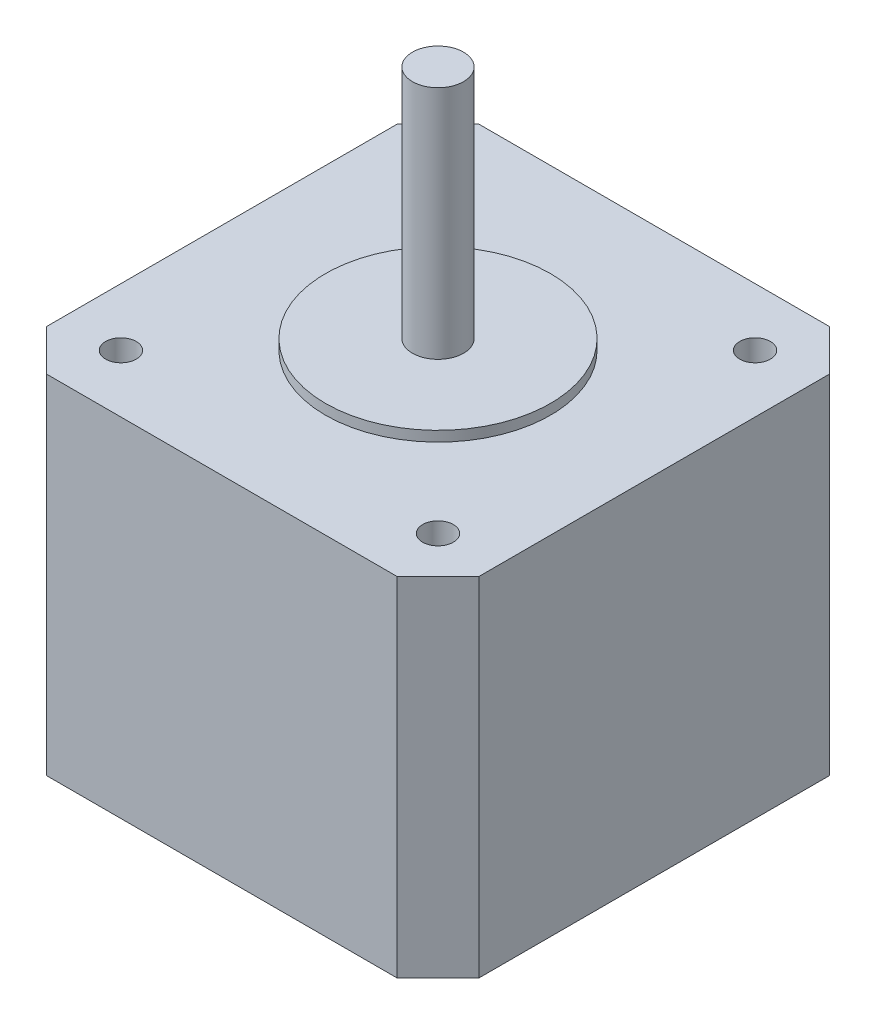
ISO-10303-21;
HEADER;
FILE_DESCRIPTION(('STEP AP214'),'2;1');
FILE_NAME('part.step','',(''),(''),'','','');
FILE_SCHEMA(('AUTOMOTIVE_DESIGN { 1 0 10303 214 1 1 1 1 }'));
ENDSEC;
DATA;
#1=APPLICATION_CONTEXT('core data for automotive mechanical design processes');
#2=APPLICATION_PROTOCOL_DEFINITION('international standard','automotive_design',2000,#1);
#3=PRODUCT_CONTEXT('',#1,'mechanical');
#4=PRODUCT('Part','Part','',(#3));
#5=PRODUCT_RELATED_PRODUCT_CATEGORY('part','',(#4));
#6=PRODUCT_DEFINITION_FORMATION('','',#4);
#7=PRODUCT_DEFINITION_CONTEXT('part definition',#1,'design');
#8=PRODUCT_DEFINITION('design','',#6,#7);
#9=PRODUCT_DEFINITION_SHAPE('','',#8);
#10=(LENGTH_UNIT() NAMED_UNIT(*) SI_UNIT(.MILLI.,.METRE.));
#11=(NAMED_UNIT(*) PLANE_ANGLE_UNIT() SI_UNIT($,.RADIAN.));
#12=(NAMED_UNIT(*) SI_UNIT($,.STERADIAN.) SOLID_ANGLE_UNIT());
#13=UNCERTAINTY_MEASURE_WITH_UNIT(LENGTH_MEASURE(1.E-05),#10,'distance_accuracy_value','');
#14=(GEOMETRIC_REPRESENTATION_CONTEXT(3) GLOBAL_UNCERTAINTY_ASSIGNED_CONTEXT((#13)) GLOBAL_UNIT_ASSIGNED_CONTEXT((#10,
#11,#12)) REPRESENTATION_CONTEXT('',''));
#15=CARTESIAN_POINT('',(0.,0.,0.));
#16=DIRECTION('',(0.,0.,1.));
#17=DIRECTION('',(1.,0.,0.));
#18=AXIS2_PLACEMENT_3D('',#15,#16,#17);
#19=CARTESIAN_POINT('',(0.,34.,0.));
#20=DIRECTION('',(1.,0.,0.));
#21=DIRECTION('',(0.,0.,-1.));
#22=AXIS2_PLACEMENT_3D('',#19,#20,#21);
#23=PLANE('',#22);
#24=DIRECTION('',(0.,0.,1.));
#25=VECTOR('',#24,1.);
#26=CARTESIAN_POINT('',(0.,34.,0.));
#27=LINE('',#26,#25);
#28=CARTESIAN_POINT('',(0.,34.,-38.3));
#29=VERTEX_POINT('',#28);
#30=CARTESIAN_POINT('',(0.,34.,-4.));
#31=VERTEX_POINT('',#30);
#32=EDGE_CURVE('E130',#29,#31,#27,.T.);
#33=ORIENTED_EDGE('',*,*,#32,.F.);
#34=DIRECTION('',(0.,-1.,0.));
#35=VECTOR('',#34,1.);
#36=CARTESIAN_POINT('',(0.,34.,-38.3));
#37=LINE('',#36,#35);
#38=CARTESIAN_POINT('',(0.,0.,-38.3));
#39=VERTEX_POINT('',#38);
#40=EDGE_CURVE('E115',#29,#39,#37,.T.);
#41=ORIENTED_EDGE('',*,*,#40,.T.);
#42=DIRECTION('',(0.,0.,1.));
#43=VECTOR('',#42,1.);
#44=CARTESIAN_POINT('',(0.,0.,0.));
#45=LINE('',#44,#43);
#46=CARTESIAN_POINT('',(0.,0.,-4.));
#47=VERTEX_POINT('',#46);
#48=EDGE_CURVE('E127',#39,#47,#45,.T.);
#49=ORIENTED_EDGE('',*,*,#48,.T.);
#50=DIRECTION('',(0.,1.,0.));
#51=VECTOR('',#50,1.);
#52=CARTESIAN_POINT('',(0.,34.,-4.));
#53=LINE('',#52,#51);
#54=EDGE_CURVE('E132',#47,#31,#53,.T.);
#55=ORIENTED_EDGE('',*,*,#54,.T.);
#56=EDGE_LOOP('',(#33,#41,#49,#55));
#57=FACE_BOUND('',#56,.T.);
#58=ADVANCED_FACE('F42',(#57),#23,.F.);
#59=CARTESIAN_POINT('',(0.,34.,0.));
#60=DIRECTION('',(0.,0.,-1.));
#61=DIRECTION('',(-1.,0.,0.));
#62=AXIS2_PLACEMENT_3D('',#59,#60,#61);
#63=PLANE('',#62);
#64=DIRECTION('',(1.,0.,0.));
#65=VECTOR('',#64,1.);
#66=CARTESIAN_POINT('',(0.,34.,0.));
#67=LINE('',#66,#65);
#68=CARTESIAN_POINT('',(4.,34.,0.));
#69=VERTEX_POINT('',#68);
#70=CARTESIAN_POINT('',(38.3,34.,0.));
#71=VERTEX_POINT('',#70);
#72=EDGE_CURVE('E203',#69,#71,#67,.T.);
#73=ORIENTED_EDGE('',*,*,#72,.F.);
#74=DIRECTION('',(0.,-1.,0.));
#75=VECTOR('',#74,1.);
#76=CARTESIAN_POINT('',(4.,34.,0.));
#77=LINE('',#76,#75);
#78=CARTESIAN_POINT('',(4.,0.,0.));
#79=VERTEX_POINT('',#78);
#80=EDGE_CURVE('E169',#69,#79,#77,.T.);
#81=ORIENTED_EDGE('',*,*,#80,.T.);
#82=DIRECTION('',(1.,0.,0.));
#83=VECTOR('',#82,1.);
#84=CARTESIAN_POINT('',(0.,0.,0.));
#85=LINE('',#84,#83);
#86=CARTESIAN_POINT('',(38.3,0.,0.));
#87=VERTEX_POINT('',#86);
#88=EDGE_CURVE('E136',#79,#87,#85,.T.);
#89=ORIENTED_EDGE('',*,*,#88,.T.);
#90=DIRECTION('',(0.,1.,0.));
#91=VECTOR('',#90,1.);
#92=CARTESIAN_POINT('',(38.3,34.,0.));
#93=LINE('',#92,#91);
#94=EDGE_CURVE('E167',#87,#71,#93,.T.);
#95=ORIENTED_EDGE('',*,*,#94,.T.);
#96=EDGE_LOOP('',(#73,#81,#89,#95));
#97=FACE_BOUND('',#96,.T.);
#98=ADVANCED_FACE('F216',(#97),#63,.F.);
#99=CARTESIAN_POINT('',(42.3,34.,0.));
#100=DIRECTION('',(-1.,0.,0.));
#101=DIRECTION('',(0.,0.,1.));
#102=AXIS2_PLACEMENT_3D('',#99,#100,#101);
#103=PLANE('',#102);
#104=DIRECTION('',(0.,0.,-1.));
#105=VECTOR('',#104,1.);
#106=CARTESIAN_POINT('',(42.3,0.,0.));
#107=LINE('',#106,#105);
#108=CARTESIAN_POINT('',(42.3,0.,-4.));
#109=VERTEX_POINT('',#108);
#110=CARTESIAN_POINT('',(42.3,0.,-38.3));
#111=VERTEX_POINT('',#110);
#112=EDGE_CURVE('E140',#109,#111,#107,.T.);
#113=ORIENTED_EDGE('',*,*,#112,.T.);
#114=DIRECTION('',(0.,1.,0.));
#115=VECTOR('',#114,1.);
#116=CARTESIAN_POINT('',(42.3,34.,-38.3));
#117=LINE('',#116,#115);
#118=CARTESIAN_POINT('',(42.3,34.,-38.3));
#119=VERTEX_POINT('',#118);
#120=EDGE_CURVE('E47',#111,#119,#117,.T.);
#121=ORIENTED_EDGE('',*,*,#120,.T.);
#122=DIRECTION('',(0.,0.,-1.));
#123=VECTOR('',#122,1.);
#124=CARTESIAN_POINT('',(42.3,34.,0.));
#125=LINE('',#124,#123);
#126=CARTESIAN_POINT('',(42.3,34.,-4.));
#127=VERTEX_POINT('',#126);
#128=EDGE_CURVE('E204',#127,#119,#125,.T.);
#129=ORIENTED_EDGE('',*,*,#128,.F.);
#130=DIRECTION('',(0.,-1.,0.));
#131=VECTOR('',#130,1.);
#132=CARTESIAN_POINT('',(42.3,34.,-4.));
#133=LINE('',#132,#131);
#134=EDGE_CURVE('E171',#127,#109,#133,.T.);
#135=ORIENTED_EDGE('',*,*,#134,.T.);
#136=EDGE_LOOP('',(#113,#121,#129,#135));
#137=FACE_BOUND('',#136,.T.);
#138=ADVANCED_FACE('F214',(#137),#103,.F.);
#139=CARTESIAN_POINT('',(0.,34.,-42.3));
#140=DIRECTION('',(0.,0.,1.));
#141=DIRECTION('',(1.,0.,0.));
#142=AXIS2_PLACEMENT_3D('',#139,#140,#141);
#143=PLANE('',#142);
#144=DIRECTION('',(-1.,0.,0.));
#145=VECTOR('',#144,1.);
#146=CARTESIAN_POINT('',(0.,0.,-42.3));
#147=LINE('',#146,#145);
#148=CARTESIAN_POINT('',(38.3,0.,-42.3));
#149=VERTEX_POINT('',#148);
#150=CARTESIAN_POINT('',(4.,0.,-42.3));
#151=VERTEX_POINT('',#150);
#152=EDGE_CURVE('E150',#149,#151,#147,.T.);
#153=ORIENTED_EDGE('',*,*,#152,.T.);
#154=DIRECTION('',(0.,1.,0.));
#155=VECTOR('',#154,1.);
#156=CARTESIAN_POINT('',(4.,34.,-42.3));
#157=LINE('',#156,#155);
#158=CARTESIAN_POINT('',(4.,34.,-42.3));
#159=VERTEX_POINT('',#158);
#160=EDGE_CURVE('E116',#151,#159,#157,.T.);
#161=ORIENTED_EDGE('',*,*,#160,.T.);
#162=DIRECTION('',(-1.,0.,0.));
#163=VECTOR('',#162,1.);
#164=CARTESIAN_POINT('',(0.,34.,-42.3));
#165=LINE('',#164,#163);
#166=CARTESIAN_POINT('',(38.3,34.,-42.3));
#167=VERTEX_POINT('',#166);
#168=EDGE_CURVE('E146',#167,#159,#165,.T.);
#169=ORIENTED_EDGE('',*,*,#168,.F.);
#170=DIRECTION('',(0.,-1.,0.));
#171=VECTOR('',#170,1.);
#172=CARTESIAN_POINT('',(38.3,34.,-42.3));
#173=LINE('',#172,#171);
#174=EDGE_CURVE('E121',#167,#149,#173,.T.);
#175=ORIENTED_EDGE('',*,*,#174,.T.);
#176=EDGE_LOOP('',(#153,#161,#169,#175));
#177=FACE_BOUND('',#176,.T.);
#178=ADVANCED_FACE('F211',(#177),#143,.F.);
#179=CARTESIAN_POINT('',(0.,34.,0.));
#180=DIRECTION('',(0.,-1.,0.));
#181=DIRECTION('',(0.,0.,-1.));
#182=AXIS2_PLACEMENT_3D('',#179,#180,#181);
#183=PLANE('',#182);
#184=CARTESIAN_POINT('',(21.15,34.,-21.15));
#185=DIRECTION('',(0.,1.,0.));
#186=DIRECTION('',(0.,0.,1.));
#187=AXIS2_PLACEMENT_3D('',#184,#185,#186);
#188=CIRCLE('',#187,11.);
#189=CARTESIAN_POINT('',(21.15,34.,-10.15));
#190=VERTEX_POINT('',#189);
#191=EDGE_CURVE('E52',#190,#190,#188,.T.);
#192=ORIENTED_EDGE('',*,*,#191,.F.);
#193=EDGE_LOOP('',(#192));
#194=FACE_BOUND('',#193,.T.);
#195=CARTESIAN_POINT('',(36.649999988,34.,-5.65));
#196=DIRECTION('',(0.,1.,0.));
#197=DIRECTION('',(0.,0.,1.));
#198=AXIS2_PLACEMENT_3D('',#195,#196,#197);
#199=CIRCLE('',#198,1.5);
#200=CARTESIAN_POINT('',(36.649999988,34.,-4.15));
#201=VERTEX_POINT('',#200);
#202=EDGE_CURVE('E197',#201,#201,#199,.T.);
#203=ORIENTED_EDGE('',*,*,#202,.F.);
#204=EDGE_LOOP('',(#203));
#205=FACE_BOUND('',#204,.T.);
#206=CARTESIAN_POINT('',(5.650000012,34.,-5.65));
#207=DIRECTION('',(0.,1.,0.));
#208=DIRECTION('',(0.,0.,1.));
#209=AXIS2_PLACEMENT_3D('',#206,#207,#208);
#210=CIRCLE('',#209,1.5);
#211=CARTESIAN_POINT('',(5.650000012,34.,-4.15));
#212=VERTEX_POINT('',#211);
#213=EDGE_CURVE('E191',#212,#212,#210,.T.);
#214=ORIENTED_EDGE('',*,*,#213,.F.);
#215=EDGE_LOOP('',(#214));
#216=FACE_BOUND('',#215,.T.);
#217=CARTESIAN_POINT('',(5.65000001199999,34.,-36.65));
#218=DIRECTION('',(0.,1.,0.));
#219=DIRECTION('',(0.,0.,1.));
#220=AXIS2_PLACEMENT_3D('',#217,#218,#219);
#221=CIRCLE('',#220,1.5);
#222=CARTESIAN_POINT('',(5.65000001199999,34.,-35.15));
#223=VERTEX_POINT('',#222);
#224=EDGE_CURVE('E185',#223,#223,#221,.T.);
#225=ORIENTED_EDGE('',*,*,#224,.F.);
#226=EDGE_LOOP('',(#225));
#227=FACE_BOUND('',#226,.T.);
#228=CARTESIAN_POINT('',(36.649999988,34.,-36.65));
#229=DIRECTION('',(0.,1.,0.));
#230=DIRECTION('',(0.,0.,1.));
#231=AXIS2_PLACEMENT_3D('',#228,#229,#230);
#232=CIRCLE('',#231,1.5);
#233=CARTESIAN_POINT('',(36.649999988,34.,-35.15));
#234=VERTEX_POINT('',#233);
#235=EDGE_CURVE('E143',#234,#234,#232,.T.);
#236=ORIENTED_EDGE('',*,*,#235,.F.);
#237=EDGE_LOOP('',(#236));
#238=FACE_BOUND('',#237,.T.);
#239=ORIENTED_EDGE('',*,*,#168,.T.);
#240=DIRECTION('',(0.707106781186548,0.,-0.707106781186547));
#241=VECTOR('',#240,1.);
#242=CARTESIAN_POINT('',(0.,34.,-38.3));
#243=LINE('',#242,#241);
#244=EDGE_CURVE('E165',#159,#29,#243,.F.);
#245=ORIENTED_EDGE('',*,*,#244,.T.);
#246=ORIENTED_EDGE('',*,*,#32,.T.);
#247=DIRECTION('',(-0.707106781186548,0.,-0.707106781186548));
#248=VECTOR('',#247,1.);
#249=CARTESIAN_POINT('',(4.,34.,0.));
#250=LINE('',#249,#248);
#251=EDGE_CURVE('E163',#31,#69,#250,.F.);
#252=ORIENTED_EDGE('',*,*,#251,.T.);
#253=ORIENTED_EDGE('',*,*,#72,.T.);
#254=DIRECTION('',(-0.707106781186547,0.,0.707106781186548));
#255=VECTOR('',#254,1.);
#256=CARTESIAN_POINT('',(42.3,34.,-4.));
#257=LINE('',#256,#255);
#258=EDGE_CURVE('E66',#71,#127,#257,.F.);
#259=ORIENTED_EDGE('',*,*,#258,.T.);
#260=ORIENTED_EDGE('',*,*,#128,.T.);
#261=DIRECTION('',(0.707106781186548,0.,0.707106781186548));
#262=VECTOR('',#261,1.);
#263=CARTESIAN_POINT('',(38.3,34.,-42.3));
#264=LINE('',#263,#262);
#265=EDGE_CURVE('E161',#119,#167,#264,.F.);
#266=ORIENTED_EDGE('',*,*,#265,.T.);
#267=EDGE_LOOP('',(#239,#245,#246,#252,#253,#259,#260,#266));
#268=FACE_BOUND('',#267,.T.);
#269=ADVANCED_FACE('F208',(#194,#205,#216,#227,#238,#268),#183,.F.);
#270=CARTESIAN_POINT('',(0.,0.,0.));
#271=DIRECTION('',(0.,-1.,0.));
#272=DIRECTION('',(0.,0.,-1.));
#273=AXIS2_PLACEMENT_3D('',#270,#271,#272);
#274=PLANE('',#273);
#275=ORIENTED_EDGE('',*,*,#48,.F.);
#276=DIRECTION('',(-0.707106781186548,0.,0.707106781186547));
#277=VECTOR('',#276,1.);
#278=CARTESIAN_POINT('',(-19.15,0.,-19.15));
#279=LINE('',#278,#277);
#280=EDGE_CURVE('E111',#39,#151,#279,.F.);
#281=ORIENTED_EDGE('',*,*,#280,.T.);
#282=ORIENTED_EDGE('',*,*,#152,.F.);
#283=DIRECTION('',(-0.707106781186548,0.,-0.707106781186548));
#284=VECTOR('',#283,1.);
#285=CARTESIAN_POINT('',(40.3,0.,-40.3));
#286=LINE('',#285,#284);
#287=EDGE_CURVE('E154',#149,#111,#286,.F.);
#288=ORIENTED_EDGE('',*,*,#287,.T.);
#289=ORIENTED_EDGE('',*,*,#112,.F.);
#290=DIRECTION('',(0.707106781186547,0.,-0.707106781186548));
#291=VECTOR('',#290,1.);
#292=CARTESIAN_POINT('',(19.15,0.,19.15));
#293=LINE('',#292,#291);
#294=EDGE_CURVE('E131',#109,#87,#293,.F.);
#295=ORIENTED_EDGE('',*,*,#294,.T.);
#296=ORIENTED_EDGE('',*,*,#88,.F.);
#297=DIRECTION('',(0.707106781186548,0.,0.707106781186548));
#298=VECTOR('',#297,1.);
#299=CARTESIAN_POINT('',(2.,0.,-2.));
#300=LINE('',#299,#298);
#301=EDGE_CURVE('E122',#79,#47,#300,.F.);
#302=ORIENTED_EDGE('',*,*,#301,.T.);
#303=EDGE_LOOP('',(#275,#281,#282,#288,#289,#295,#296,#302));
#304=FACE_BOUND('',#303,.T.);
#305=ADVANCED_FACE('F134',(#304),#274,.T.);
#306=CARTESIAN_POINT('',(36.649999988,29.5,-36.65));
#307=DIRECTION('',(0.,1.,0.));
#308=DIRECTION('',(0.,0.,1.));
#309=AXIS2_PLACEMENT_3D('',#306,#307,#308);
#310=CYLINDRICAL_SURFACE('',#309,1.5);
#311=CARTESIAN_POINT('',(36.649999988,29.5,-36.65));
#312=DIRECTION('',(0.,1.,0.));
#313=DIRECTION('',(0.,0.,1.));
#314=AXIS2_PLACEMENT_3D('',#311,#312,#313);
#315=CIRCLE('',#314,1.5);
#316=CARTESIAN_POINT('',(36.649999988,29.5,-35.15));
#317=VERTEX_POINT('',#316);
#318=EDGE_CURVE('E137',#317,#317,#315,.T.);
#319=ORIENTED_EDGE('',*,*,#318,.F.);
#320=EDGE_LOOP('',(#319));
#321=FACE_BOUND('',#320,.T.);
#322=ORIENTED_EDGE('',*,*,#235,.T.);
#323=EDGE_LOOP('',(#322));
#324=FACE_BOUND('',#323,.T.);
#325=ADVANCED_FACE('F296',(#321,#324),#310,.F.);
#326=CARTESIAN_POINT('',(36.649999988,29.5,-36.65));
#327=DIRECTION('',(0.,1.,0.));
#328=DIRECTION('',(0.,0.,1.));
#329=AXIS2_PLACEMENT_3D('',#326,#327,#328);
#330=PLANE('',#329);
#331=ORIENTED_EDGE('',*,*,#318,.T.);
#332=EDGE_LOOP('',(#331));
#333=FACE_BOUND('',#332,.T.);
#334=ADVANCED_FACE('F278',(#333),#330,.T.);
#335=CARTESIAN_POINT('',(5.65000001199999,29.5,-36.65));
#336=DIRECTION('',(0.,1.,0.));
#337=DIRECTION('',(0.,0.,1.));
#338=AXIS2_PLACEMENT_3D('',#335,#336,#337);
#339=CYLINDRICAL_SURFACE('',#338,1.5);
#340=CARTESIAN_POINT('',(5.65000001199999,29.5,-36.65));
#341=DIRECTION('',(0.,1.,0.));
#342=DIRECTION('',(0.,0.,1.));
#343=AXIS2_PLACEMENT_3D('',#340,#341,#342);
#344=CIRCLE('',#343,1.5);
#345=CARTESIAN_POINT('',(5.65000001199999,29.5,-35.15));
#346=VERTEX_POINT('',#345);
#347=EDGE_CURVE('E182',#346,#346,#344,.T.);
#348=ORIENTED_EDGE('',*,*,#347,.F.);
#349=EDGE_LOOP('',(#348));
#350=FACE_BOUND('',#349,.T.);
#351=ORIENTED_EDGE('',*,*,#224,.T.);
#352=EDGE_LOOP('',(#351));
#353=FACE_BOUND('',#352,.T.);
#354=ADVANCED_FACE('F274',(#350,#353),#339,.F.);
#355=CARTESIAN_POINT('',(5.65000001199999,29.5,-36.65));
#356=DIRECTION('',(0.,1.,0.));
#357=DIRECTION('',(0.,0.,1.));
#358=AXIS2_PLACEMENT_3D('',#355,#356,#357);
#359=PLANE('',#358);
#360=ORIENTED_EDGE('',*,*,#347,.T.);
#361=EDGE_LOOP('',(#360));
#362=FACE_BOUND('',#361,.T.);
#363=ADVANCED_FACE('F270',(#362),#359,.T.);
#364=CARTESIAN_POINT('',(5.650000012,29.5,-5.65));
#365=DIRECTION('',(0.,1.,0.));
#366=DIRECTION('',(0.,0.,1.));
#367=AXIS2_PLACEMENT_3D('',#364,#365,#366);
#368=CYLINDRICAL_SURFACE('',#367,1.5);
#369=CARTESIAN_POINT('',(5.650000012,29.5,-5.65));
#370=DIRECTION('',(0.,1.,0.));
#371=DIRECTION('',(0.,0.,1.));
#372=AXIS2_PLACEMENT_3D('',#369,#370,#371);
#373=CIRCLE('',#372,1.5);
#374=CARTESIAN_POINT('',(5.650000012,29.5,-4.15));
#375=VERTEX_POINT('',#374);
#376=EDGE_CURVE('E188',#375,#375,#373,.T.);
#377=ORIENTED_EDGE('',*,*,#376,.F.);
#378=EDGE_LOOP('',(#377));
#379=FACE_BOUND('',#378,.T.);
#380=ORIENTED_EDGE('',*,*,#213,.T.);
#381=EDGE_LOOP('',(#380));
#382=FACE_BOUND('',#381,.T.);
#383=ADVANCED_FACE('F273',(#379,#382),#368,.F.);
#384=CARTESIAN_POINT('',(5.650000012,29.5,-5.65));
#385=DIRECTION('',(0.,1.,0.));
#386=DIRECTION('',(0.,0.,1.));
#387=AXIS2_PLACEMENT_3D('',#384,#385,#386);
#388=PLANE('',#387);
#389=ORIENTED_EDGE('',*,*,#376,.T.);
#390=EDGE_LOOP('',(#389));
#391=FACE_BOUND('',#390,.T.);
#392=ADVANCED_FACE('F280',(#391),#388,.T.);
#393=CARTESIAN_POINT('',(36.649999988,29.5,-5.65));
#394=DIRECTION('',(0.,1.,0.));
#395=DIRECTION('',(0.,0.,1.));
#396=AXIS2_PLACEMENT_3D('',#393,#394,#395);
#397=CYLINDRICAL_SURFACE('',#396,1.5);
#398=CARTESIAN_POINT('',(36.649999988,29.5,-5.65));
#399=DIRECTION('',(0.,1.,0.));
#400=DIRECTION('',(0.,0.,1.));
#401=AXIS2_PLACEMENT_3D('',#398,#399,#400);
#402=CIRCLE('',#401,1.5);
#403=CARTESIAN_POINT('',(36.649999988,29.5,-4.15));
#404=VERTEX_POINT('',#403);
#405=EDGE_CURVE('E194',#404,#404,#402,.T.);
#406=ORIENTED_EDGE('',*,*,#405,.F.);
#407=EDGE_LOOP('',(#406));
#408=FACE_BOUND('',#407,.T.);
#409=ORIENTED_EDGE('',*,*,#202,.T.);
#410=EDGE_LOOP('',(#409));
#411=FACE_BOUND('',#410,.T.);
#412=ADVANCED_FACE('F283',(#408,#411),#397,.F.);
#413=CARTESIAN_POINT('',(36.649999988,29.5,-5.65));
#414=DIRECTION('',(0.,1.,0.));
#415=DIRECTION('',(0.,0.,1.));
#416=AXIS2_PLACEMENT_3D('',#413,#414,#415);
#417=PLANE('',#416);
#418=ORIENTED_EDGE('',*,*,#405,.T.);
#419=EDGE_LOOP('',(#418));
#420=FACE_BOUND('',#419,.T.);
#421=ADVANCED_FACE('F237',(#420),#417,.T.);
#422=CARTESIAN_POINT('',(0.,34.,-38.3));
#423=DIRECTION('',(0.707106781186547,0.,0.707106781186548));
#424=DIRECTION('',(0.,-1.,0.));
#425=AXIS2_PLACEMENT_3D('',#422,#423,#424);
#426=PLANE('',#425);
#427=ORIENTED_EDGE('',*,*,#244,.F.);
#428=ORIENTED_EDGE('',*,*,#160,.F.);
#429=ORIENTED_EDGE('',*,*,#280,.F.);
#430=ORIENTED_EDGE('',*,*,#40,.F.);
#431=EDGE_LOOP('',(#427,#428,#429,#430));
#432=FACE_BOUND('',#431,.T.);
#433=ADVANCED_FACE('F114',(#432),#426,.F.);
#434=CARTESIAN_POINT('',(4.,34.,0.));
#435=DIRECTION('',(0.707106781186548,0.,-0.707106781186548));
#436=DIRECTION('',(0.,-1.,0.));
#437=AXIS2_PLACEMENT_3D('',#434,#435,#436);
#438=PLANE('',#437);
#439=ORIENTED_EDGE('',*,*,#251,.F.);
#440=ORIENTED_EDGE('',*,*,#54,.F.);
#441=ORIENTED_EDGE('',*,*,#301,.F.);
#442=ORIENTED_EDGE('',*,*,#80,.F.);
#443=EDGE_LOOP('',(#439,#440,#441,#442));
#444=FACE_BOUND('',#443,.T.);
#445=ADVANCED_FACE('F236',(#444),#438,.F.);
#446=CARTESIAN_POINT('',(38.3,34.,-42.3));
#447=DIRECTION('',(-0.707106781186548,0.,0.707106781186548));
#448=DIRECTION('',(0.,-1.,0.));
#449=AXIS2_PLACEMENT_3D('',#446,#447,#448);
#450=PLANE('',#449);
#451=ORIENTED_EDGE('',*,*,#265,.F.);
#452=ORIENTED_EDGE('',*,*,#120,.F.);
#453=ORIENTED_EDGE('',*,*,#287,.F.);
#454=ORIENTED_EDGE('',*,*,#174,.F.);
#455=EDGE_LOOP('',(#451,#452,#453,#454));
#456=FACE_BOUND('',#455,.T.);
#457=ADVANCED_FACE('F213',(#456),#450,.F.);
#458=CARTESIAN_POINT('',(42.3,34.,-4.));
#459=DIRECTION('',(-0.707106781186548,0.,-0.707106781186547));
#460=DIRECTION('',(0.,-1.,0.));
#461=AXIS2_PLACEMENT_3D('',#458,#459,#460);
#462=PLANE('',#461);
#463=ORIENTED_EDGE('',*,*,#258,.F.);
#464=ORIENTED_EDGE('',*,*,#94,.F.);
#465=ORIENTED_EDGE('',*,*,#294,.F.);
#466=ORIENTED_EDGE('',*,*,#134,.F.);
#467=EDGE_LOOP('',(#463,#464,#465,#466));
#468=FACE_BOUND('',#467,.T.);
#469=ADVANCED_FACE('F45',(#468),#462,.F.);
#470=CARTESIAN_POINT('',(21.15,35.,-21.15));
#471=DIRECTION('',(0.,-1.,0.));
#472=DIRECTION('',(0.,0.,-1.));
#473=AXIS2_PLACEMENT_3D('',#470,#471,#472);
#474=CYLINDRICAL_SURFACE('',#473,11.);
#475=CARTESIAN_POINT('',(21.15,35.,-21.15));
#476=DIRECTION('',(0.,1.,0.));
#477=DIRECTION('',(0.,0.,1.));
#478=AXIS2_PLACEMENT_3D('',#475,#476,#477);
#479=CIRCLE('',#478,11.);
#480=CARTESIAN_POINT('',(21.15,35.,-10.15));
#481=VERTEX_POINT('',#480);
#482=EDGE_CURVE('E181',#481,#481,#479,.T.);
#483=ORIENTED_EDGE('',*,*,#482,.F.);
#484=EDGE_LOOP('',(#483));
#485=FACE_BOUND('',#484,.T.);
#486=ORIENTED_EDGE('',*,*,#191,.T.);
#487=EDGE_LOOP('',(#486));
#488=FACE_BOUND('',#487,.T.);
#489=ADVANCED_FACE('F249',(#485,#488),#474,.T.);
#490=CARTESIAN_POINT('',(21.15,35.,-21.15));
#491=DIRECTION('',(0.,1.,0.));
#492=DIRECTION('',(0.,0.,1.));
#493=AXIS2_PLACEMENT_3D('',#490,#491,#492);
#494=PLANE('',#493);
#495=CARTESIAN_POINT('',(21.15,35.,-21.15));
#496=DIRECTION('',(0.,1.,0.));
#497=DIRECTION('',(0.,0.,1.));
#498=AXIS2_PLACEMENT_3D('',#495,#496,#497);
#499=CIRCLE('',#498,2.5);
#500=CARTESIAN_POINT('',(21.15,35.,-18.65));
#501=VERTEX_POINT('',#500);
#502=EDGE_CURVE('E13',#501,#501,#499,.T.);
#503=ORIENTED_EDGE('',*,*,#502,.F.);
#504=EDGE_LOOP('',(#503));
#505=FACE_BOUND('',#504,.T.);
#506=ORIENTED_EDGE('',*,*,#482,.T.);
#507=EDGE_LOOP('',(#506));
#508=FACE_BOUND('',#507,.T.);
#509=ADVANCED_FACE('F254',(#505,#508),#494,.T.);
#510=CARTESIAN_POINT('',(21.15,58.,-21.15));
#511=DIRECTION('',(0.,-1.,0.));
#512=DIRECTION('',(0.,0.,-1.));
#513=AXIS2_PLACEMENT_3D('',#510,#511,#512);
#514=CYLINDRICAL_SURFACE('',#513,2.5);
#515=CARTESIAN_POINT('',(21.15,58.,-21.15));
#516=DIRECTION('',(0.,1.,0.));
#517=DIRECTION('',(0.,0.,1.));
#518=AXIS2_PLACEMENT_3D('',#515,#516,#517);
#519=CIRCLE('',#518,2.5);
#520=CARTESIAN_POINT('',(21.15,58.,-18.65));
#521=VERTEX_POINT('',#520);
#522=EDGE_CURVE('E397',#521,#521,#519,.T.);
#523=ORIENTED_EDGE('',*,*,#522,.F.);
#524=EDGE_LOOP('',(#523));
#525=FACE_BOUND('',#524,.T.);
#526=ORIENTED_EDGE('',*,*,#502,.T.);
#527=EDGE_LOOP('',(#526));
#528=FACE_BOUND('',#527,.T.);
#529=ADVANCED_FACE('F264',(#525,#528),#514,.T.);
#530=CARTESIAN_POINT('',(21.15,58.,-21.15));
#531=DIRECTION('',(0.,1.,0.));
#532=DIRECTION('',(0.,0.,1.));
#533=AXIS2_PLACEMENT_3D('',#530,#531,#532);
#534=PLANE('',#533);
#535=ORIENTED_EDGE('',*,*,#522,.T.);
#536=EDGE_LOOP('',(#535));
#537=FACE_BOUND('',#536,.T.);
#538=ADVANCED_FACE('F382',(#537),#534,.T.);
#539=CLOSED_SHELL('',(#58,#98,#138,#178,#269,#305,#325,#334,#354,#363,#383,#392,#412,#421,#433,
#445,#457,#469,#489,#509,#529,#538));
#540=MANIFOLD_SOLID_BREP('B2',#539);
#541=ADVANCED_BREP_SHAPE_REPRESENTATION('',(#18,#540),#14);
#542=SHAPE_DEFINITION_REPRESENTATION(#9,#541);
ENDSEC;
END-ISO-10303-21;
